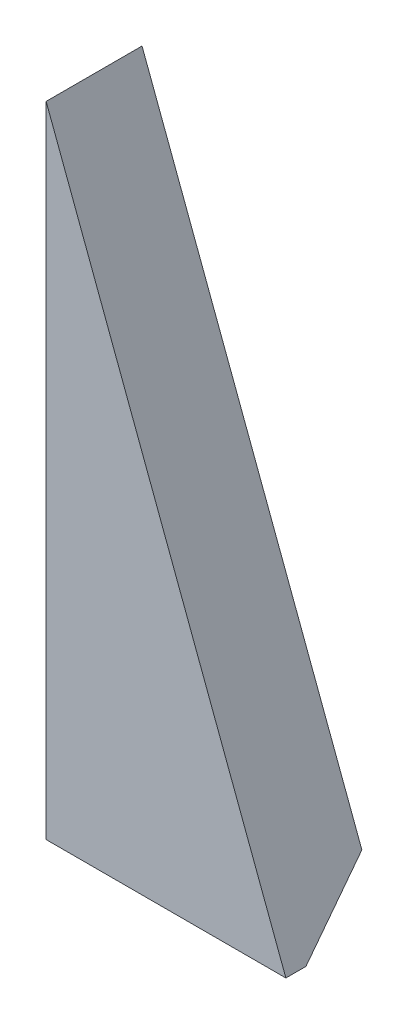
ISO-10303-21;
HEADER;
FILE_DESCRIPTION(('STEP AP214'),'2;1');
FILE_NAME('part.step','',(''),(''),'','','');
FILE_SCHEMA(('AUTOMOTIVE_DESIGN { 1 0 10303 214 1 1 1 1 }'));
ENDSEC;
DATA;
#1=APPLICATION_CONTEXT('core data for automotive mechanical design processes');
#2=APPLICATION_PROTOCOL_DEFINITION('international standard','automotive_design',2000,#1);
#3=PRODUCT_CONTEXT('',#1,'mechanical');
#4=PRODUCT('Part','Part','',(#3));
#5=PRODUCT_RELATED_PRODUCT_CATEGORY('part','',(#4));
#6=PRODUCT_DEFINITION_FORMATION('','',#4);
#7=PRODUCT_DEFINITION_CONTEXT('part definition',#1,'design');
#8=PRODUCT_DEFINITION('design','',#6,#7);
#9=PRODUCT_DEFINITION_SHAPE('','',#8);
#10=(LENGTH_UNIT() NAMED_UNIT(*) SI_UNIT(.MILLI.,.METRE.));
#11=(NAMED_UNIT(*) PLANE_ANGLE_UNIT() SI_UNIT($,.RADIAN.));
#12=(NAMED_UNIT(*) SI_UNIT($,.STERADIAN.) SOLID_ANGLE_UNIT());
#13=UNCERTAINTY_MEASURE_WITH_UNIT(LENGTH_MEASURE(1.E-05),#10,'distance_accuracy_value','');
#14=(GEOMETRIC_REPRESENTATION_CONTEXT(3) GLOBAL_UNCERTAINTY_ASSIGNED_CONTEXT((#13)) GLOBAL_UNIT_ASSIGNED_CONTEXT((#10,
#11,#12)) REPRESENTATION_CONTEXT('',''));
#15=CARTESIAN_POINT('',(0.,0.,0.));
#16=DIRECTION('',(0.,0.,1.));
#17=DIRECTION('',(1.,0.,0.));
#18=AXIS2_PLACEMENT_3D('',#15,#16,#17);
#19=CARTESIAN_POINT('',(8.860009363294,33.860009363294,0.));
#20=DIRECTION('',(0.,0.,1.));
#21=DIRECTION('',(1.,0.,0.));
#22=AXIS2_PLACEMENT_3D('',#19,#20,#21);
#23=PLANE('',#22);
#24=DIRECTION('',(-0.351123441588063,0.936329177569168,0.));
#25=VECTOR('',#24,1.);
#26=CARTESIAN_POINT('',(30.,0.,0.));
#27=LINE('',#26,#25);
#28=CARTESIAN_POINT('',(27.50950832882,6.641311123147,0.));
#29=VERTEX_POINT('',#28);
#30=CARTESIAN_POINT('',(0.,80.,0.));
#31=VERTEX_POINT('',#30);
#32=EDGE_CURVE('E82',#29,#31,#27,.T.);
#33=ORIENTED_EDGE('',*,*,#32,.F.);
#34=DIRECTION('',(-1.,0.,0.));
#35=VECTOR('',#34,1.);
#36=CARTESIAN_POINT('',(-8.069995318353,6.641311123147,0.));
#37=LINE('',#36,#35);
#38=CARTESIAN_POINT('',(0.,6.641311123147,0.));
#39=VERTEX_POINT('',#38);
#40=EDGE_CURVE('E77',#29,#39,#37,.T.);
#41=ORIENTED_EDGE('',*,*,#40,.T.);
#42=DIRECTION('',(0.,-1.,0.));
#43=VECTOR('',#42,1.);
#44=CARTESIAN_POINT('',(0.,80.,0.));
#45=LINE('',#44,#43);
#46=EDGE_CURVE('E10',#31,#39,#45,.T.);
#47=ORIENTED_EDGE('',*,*,#46,.F.);
#48=EDGE_LOOP('',(#33,#41,#47));
#49=FACE_BOUND('',#48,.T.);
#50=ADVANCED_FACE('F16',(#49),#23,.F.);
#51=CARTESIAN_POINT('',(0.,80.,0.));
#52=DIRECTION('',(1.,0.,0.));
#53=DIRECTION('',(0.,1.,0.));
#54=AXIS2_PLACEMENT_3D('',#51,#52,#53);
#55=PLANE('',#54);
#56=DIRECTION('',(0.,-0.573462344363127,0.819231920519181));
#57=VECTOR('',#56,1.);
#58=CARTESIAN_POINT('',(0.,12.187985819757,-7.923820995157));
#59=LINE('',#58,#57);
#60=CARTESIAN_POINT('',(0.,0.,9.487587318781));
#61=VERTEX_POINT('',#60);
#62=EDGE_CURVE('E91',#39,#61,#59,.T.);
#63=ORIENTED_EDGE('',*,*,#62,.T.);
#64=DIRECTION('',(0.,0.,1.));
#65=VECTOR('',#64,1.);
#66=CARTESIAN_POINT('',(0.,0.,0.));
#67=LINE('',#66,#65);
#68=CARTESIAN_POINT('',(0.,0.,12.));
#69=VERTEX_POINT('',#68);
#70=EDGE_CURVE('E89',#61,#69,#67,.T.);
#71=ORIENTED_EDGE('',*,*,#70,.T.);
#72=DIRECTION('',(0.,-1.,0.));
#73=VECTOR('',#72,1.);
#74=CARTESIAN_POINT('',(0.,80.,12.));
#75=LINE('',#74,#73);
#76=CARTESIAN_POINT('',(0.,80.,12.));
#77=VERTEX_POINT('',#76);
#78=EDGE_CURVE('E25',#77,#69,#75,.T.);
#79=ORIENTED_EDGE('',*,*,#78,.F.);
#80=DIRECTION('',(0.,0.,1.));
#81=VECTOR('',#80,1.);
#82=CARTESIAN_POINT('',(0.,80.,0.));
#83=LINE('',#82,#81);
#84=EDGE_CURVE('E105',#31,#77,#83,.T.);
#85=ORIENTED_EDGE('',*,*,#84,.F.);
#86=ORIENTED_EDGE('',*,*,#46,.T.);
#87=EDGE_LOOP('',(#63,#71,#79,#85,#86));
#88=FACE_BOUND('',#87,.T.);
#89=ADVANCED_FACE('F116',(#88),#55,.F.);
#90=CARTESIAN_POINT('',(8.860009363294,33.860009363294,12.));
#91=DIRECTION('',(0.,0.,1.));
#92=DIRECTION('',(1.,0.,0.));
#93=AXIS2_PLACEMENT_3D('',#90,#91,#92);
#94=PLANE('',#93);
#95=DIRECTION('',(1.,0.,0.));
#96=VECTOR('',#95,1.);
#97=CARTESIAN_POINT('',(0.,0.,12.));
#98=LINE('',#97,#96);
#99=CARTESIAN_POINT('',(30.,0.,12.));
#100=VERTEX_POINT('',#99);
#101=EDGE_CURVE('E97',#69,#100,#98,.T.);
#102=ORIENTED_EDGE('',*,*,#101,.T.);
#103=DIRECTION('',(-0.351123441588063,0.936329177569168,0.));
#104=VECTOR('',#103,1.);
#105=CARTESIAN_POINT('',(30.,0.,12.));
#106=LINE('',#105,#104);
#107=EDGE_CURVE('E19',#100,#77,#106,.T.);
#108=ORIENTED_EDGE('',*,*,#107,.T.);
#109=ORIENTED_EDGE('',*,*,#78,.T.);
#110=EDGE_LOOP('',(#102,#108,#109));
#111=FACE_BOUND('',#110,.T.);
#112=ADVANCED_FACE('F118',(#111),#94,.T.);
#113=CARTESIAN_POINT('',(30.,0.,0.));
#114=DIRECTION('',(-0.936329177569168,-0.351123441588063,0.));
#115=DIRECTION('',(-0.351123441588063,0.936329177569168,0.));
#116=AXIS2_PLACEMENT_3D('',#113,#114,#115);
#117=PLANE('',#116);
#118=ORIENTED_EDGE('',*,*,#32,.T.);
#119=ORIENTED_EDGE('',*,*,#84,.T.);
#120=ORIENTED_EDGE('',*,*,#107,.F.);
#121=DIRECTION('',(0.,0.,1.));
#122=VECTOR('',#121,1.);
#123=CARTESIAN_POINT('',(30.,0.,0.));
#124=LINE('',#123,#122);
#125=CARTESIAN_POINT('',(30.,0.,9.487587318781));
#126=VERTEX_POINT('',#125);
#127=EDGE_CURVE('E88',#126,#100,#124,.T.);
#128=ORIENTED_EDGE('',*,*,#127,.F.);
#129=DIRECTION('',(-0.210241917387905,0.560645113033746,-0.800921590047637));
#130=VECTOR('',#129,1.);
#131=CARTESIAN_POINT('',(29.130827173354,2.31779420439,6.176452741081));
#132=LINE('',#131,#130);
#133=EDGE_CURVE('E71',#126,#29,#132,.T.);
#134=ORIENTED_EDGE('',*,*,#133,.T.);
#135=EDGE_LOOP('',(#118,#119,#120,#128,#134));
#136=FACE_BOUND('',#135,.T.);
#137=ADVANCED_FACE('F93',(#136),#117,.F.);
#138=CARTESIAN_POINT('',(-25.,-6.390008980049,18.616171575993));
#139=DIRECTION('',(0.,0.819231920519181,0.573462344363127));
#140=DIRECTION('',(1.,0.,0.));
#141=AXIS2_PLACEMENT_3D('',#138,#139,#140);
#142=PLANE('',#141);
#143=ORIENTED_EDGE('',*,*,#62,.F.);
#144=ORIENTED_EDGE('',*,*,#40,.F.);
#145=ORIENTED_EDGE('',*,*,#133,.F.);
#146=DIRECTION('',(1.,0.,0.));
#147=VECTOR('',#146,1.);
#148=CARTESIAN_POINT('',(-12.5,0.,9.487587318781));
#149=LINE('',#148,#147);
#150=EDGE_CURVE('E75',#61,#126,#149,.T.);
#151=ORIENTED_EDGE('',*,*,#150,.F.);
#152=EDGE_LOOP('',(#143,#144,#145,#151));
#153=FACE_BOUND('',#152,.T.);
#154=ADVANCED_FACE('F74',(#153),#142,.F.);
#155=CARTESIAN_POINT('',(0.,0.,0.));
#156=DIRECTION('',(0.,1.,0.));
#157=DIRECTION('',(1.,0.,0.));
#158=AXIS2_PLACEMENT_3D('',#155,#156,#157);
#159=PLANE('',#158);
#160=ORIENTED_EDGE('',*,*,#127,.T.);
#161=ORIENTED_EDGE('',*,*,#101,.F.);
#162=ORIENTED_EDGE('',*,*,#70,.F.);
#163=ORIENTED_EDGE('',*,*,#150,.T.);
#164=EDGE_LOOP('',(#160,#161,#162,#163));
#165=FACE_BOUND('',#164,.T.);
#166=ADVANCED_FACE('F86',(#165),#159,.F.);
#167=CLOSED_SHELL('',(#50,#89,#112,#137,#154,#166));
#168=MANIFOLD_SOLID_BREP('B1',#167);
#169=ADVANCED_BREP_SHAPE_REPRESENTATION('',(#18,#168),#14);
#170=SHAPE_DEFINITION_REPRESENTATION(#9,#169);
ENDSEC;
END-ISO-10303-21;
